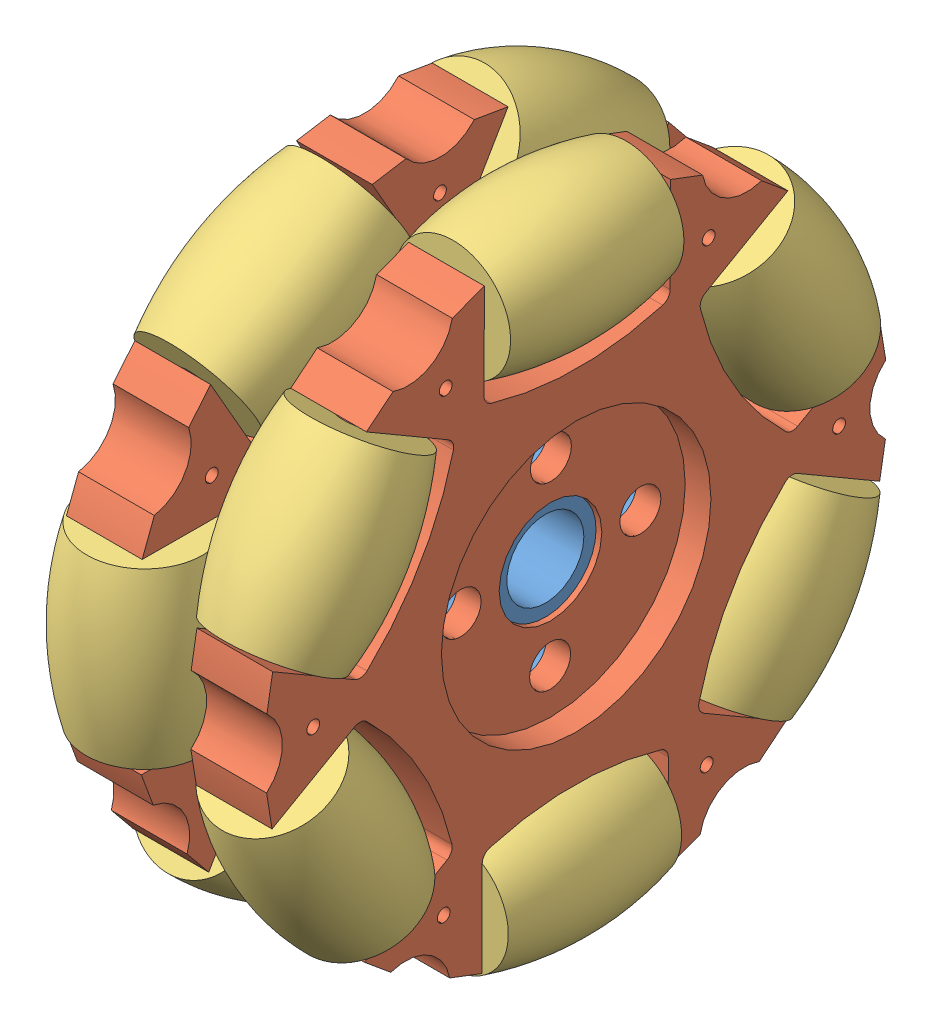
SolidWorks assembly 航发两寸全向轮.SLDASM, configuration 默认 (file format 9000). Lengths in mm.
Overall size (25.96 55.31 55.33).
15 component instances, 3 part files, 11 mates.
Components (placement in the parent):
- 小轮法兰-1: 小轮法兰.SLDPRT [默认] at (0 -24.8887 14.9321) x (0 -0.99999 0.004436) z (0 0.004436 0.99999) size (19 11.8 19)
- 2寸全向轮轮架-1: 2寸全向轮轮架.SLDPRT [默认] at (-5.275 -24.8887 14.9321) x (0 -0.99999 0.004436) z (0 0.004436 0.99999) size (48.21 5.9 46.28)
- 2寸全向轮轮架-2: 2寸全向轮轮架.SLDPRT [默认] at (5.325 -24.8887 14.9321) x (0 0.004436 0.99999) z (0 -0.99999 0.004436) size (48.21 5.9 46.28)
- 小滚轮-1: 小滚轮.SLDPRT [默认] at (-5.325 -24.8 34.9319) x (0.71018 -0.003123 -0.704014) z (0 -0.99999 0.004436) size (10.8 10.8 13.5)
- 小滚轮-2: 小滚轮.SLDPRT [默认] at (5.375 -14.812 32.2081) x (0.742219 0.337649 0.578881) z (0 -0.863799 0.503836) size (10.8 10.8 13.5)
- 小滚轮-3: 小滚轮.SLDPRT [默认] at (-5.325 -7.524 24.8552) x (0.71018 -0.611255 -0.349302) z (0 -0.496154 0.868235) size (10.8 10.8 13.5)
- 小滚轮-4: 小滚轮.SLDPRT [默认] at (-5.325 -7.6128 4.8554) x (0.71018 -0.608132 0.354711) z (0 0.503836 0.863799) size (10.8 10.8 13.5)
- 小滚轮-5: 小滚轮.SLDPRT [默认] at (-5.325 -24.9775 -5.0677) x (0.71018 0.003123 0.704014) z (0 0.99999 -0.004436) size (10.8 10.8 13.5)
- 小滚轮-6: 小滚轮.SLDPRT [默认] at (-5.325 -42.2534 5.009) x (0.71018 0.611255 0.349302) z (0 0.496154 -0.868235) size (10.8 10.8 13.5)
- 小滚轮-7: 小滚轮.SLDPRT [默认] at (-5.325 -42.1647 25.0088) x (0.71018 0.608132 -0.354711) z (0 -0.503836 -0.863799) size (10.8 10.8 13.5)
- 小滚轮-8: 小滚轮.SLDPRT [默认] at (5.375 -4.8889 14.8434) x (0.742219 0.67015 -0.002973) z (0 0.004436 0.99999) size (10.8 10.8 13.5)
- 小滚轮-9: 小滚轮.SLDPRT [默认] at (5.375 -14.9657 -2.4326) x (0.742219 0.332501 -0.581854) z (0 0.868235 0.496154) size (10.8 10.8 13.5)
- 小滚轮-10: 小滚轮.SLDPRT [默认] at (5.375 -34.9655 -2.3439) x (0.742219 -0.337649 -0.578881) z (0 0.863799 -0.503836) size (10.8 10.8 13.5)
- 小滚轮-11: 小滚轮.SLDPRT [默认] at (5.375 -44.8885 15.0208) x (0.742219 -0.67015 0.002973) z (0 -0.004436 -0.99999) size (10.8 10.8 13.5)
- 小滚轮-12: 小滚轮.SLDPRT [默认] at (5.375 -34.8118 32.2968) x (0.742219 -0.332501 0.581854) z (0 -0.868235 -0.496154) size (10.8 10.8 13.5)
Mates (geometry in assembly coordinates):
- 距离1: distance = 4.375 mm anti-aligned: plane of assembly through (0 0 0) normal (1 0 0); plane of 小轮法兰-1 through (-4.375 -34.3886 14.9742) normal (-1 0 0)
- 同心1: concentric anti-aligned: cylinder of 小轮法兰-1 through (-5.875 -24.8887 14.9321) axis (1 0 0) radius 3.95; cylinder of 2寸全向轮轮架-1 through (-2.375 -24.8887 14.9321) axis (-1 0 0) radius 4
- 同心2: concentric aligned: cylinder of 小轮法兰-1 through (-4.375 -24.8577 21.932) axis (-1 0 0) radius 1.6; cylinder of 2寸全向轮轮架-1 through (-6.275 -24.8577 21.932) axis (-1 0 0) radius 1.6
- 同心3: concentric anti-aligned: cylinder of 小轮法兰-1 through (-5.875 -24.8887 14.9321) axis (-1 0 0) radius 3; cylinder of 2寸全向轮轮架-2 through (2.425 -24.8887 14.9321) axis (1 0 0) radius 4
- 同心5: concentric anti-aligned: cylinder of 小轮法兰-1 through (-4.375 -31.8887 14.9631) axis (-1 0 0) radius 1.6; cylinder of 2寸全向轮轮架-2 through (6.325 -31.8887 14.9631) axis (1 0 0) radius 1.6
- 同心6: concentric anti-aligned: cylinder of 2寸全向轮轮架-1 through (-5.325 -32.05 34.964) axis (0 0.99999 -0.004436) radius 1.5; cylinder of 小滚轮-1 through (-5.325 -18.0501 34.9019) axis (0 -0.99999 0.004436) radius 1.5
- 距离2: distance = 0.5 mm anti-aligned: plane of 小滚轮-1 through (-2.1292 -18.0641 31.7339) normal (0 0.99999 -0.004436); plane of 2寸全向轮轮架-1 through (-8.275 -17.5717 30.0406) normal (0 -0.99999 0.004436)
- 距离3: distance = 0.5 mm anti-aligned: plane of 小滚轮-2 through (6.4883 -20.1362 36.4773) normal (0 -0.863799 0.503836); plane of 2寸全向轮轮架-2 through (8.325 -23.5228 31.6636) normal (0 0.863799 -0.503836)
- 同心7: concentric aligned: cylinder of 小滚轮-2 through (5.375 -8.9814 28.8072) axis (0 -0.863799 0.503836) radius 1.5; cylinder of 2寸全向轮轮架-2 through (5.375 -8.5495 28.5553) axis (0 -0.863799 0.503836) radius 1.5
- 重合5: coincident anti-aligned: plane of 小轮法兰-1 through (-4.375 -34.3886 14.9742) normal (-1 0 0); plane of 2寸全向轮轮架-1 through (-4.375 -28.8887 14.9498) normal (1 0 0)
- 重合6: coincident anti-aligned: plane of 小轮法兰-1 through (4.425 -24.8887 14.9321) normal (1 0 0); plane of 2寸全向轮轮架-2 through (4.425 -24.871 18.932) normal (-1 0 0)
